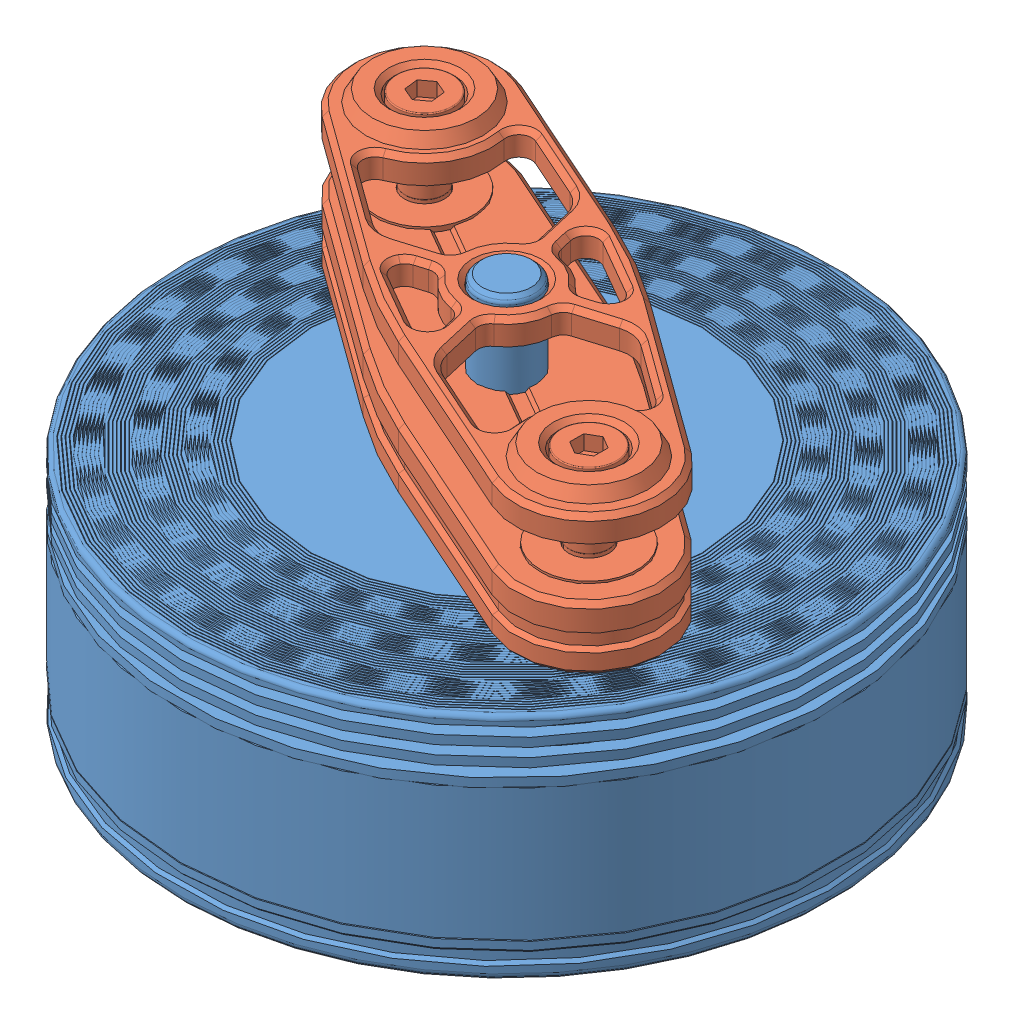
SolidWorks assembly M600 ARM_7-002.sldasm, configuration Default (file format 10000). Lengths in mm.
Overall size (66.7 44.1 67.01).
2 component instances, 2 part files, 0 mates.
Components (placement in the parent):
- M600 ARM_6-22-1: M600 ARM_6-22.sldprt [Default] at origin size (66.7 43.4 67.01)
- M600 ARM_6-23-1: M600 ARM_6-23.sldprt [Default] at (0 40.9 0) x (0.866025 0 0.5) z (-0.5 0 0.866025) size (61 20.5 19.4)
